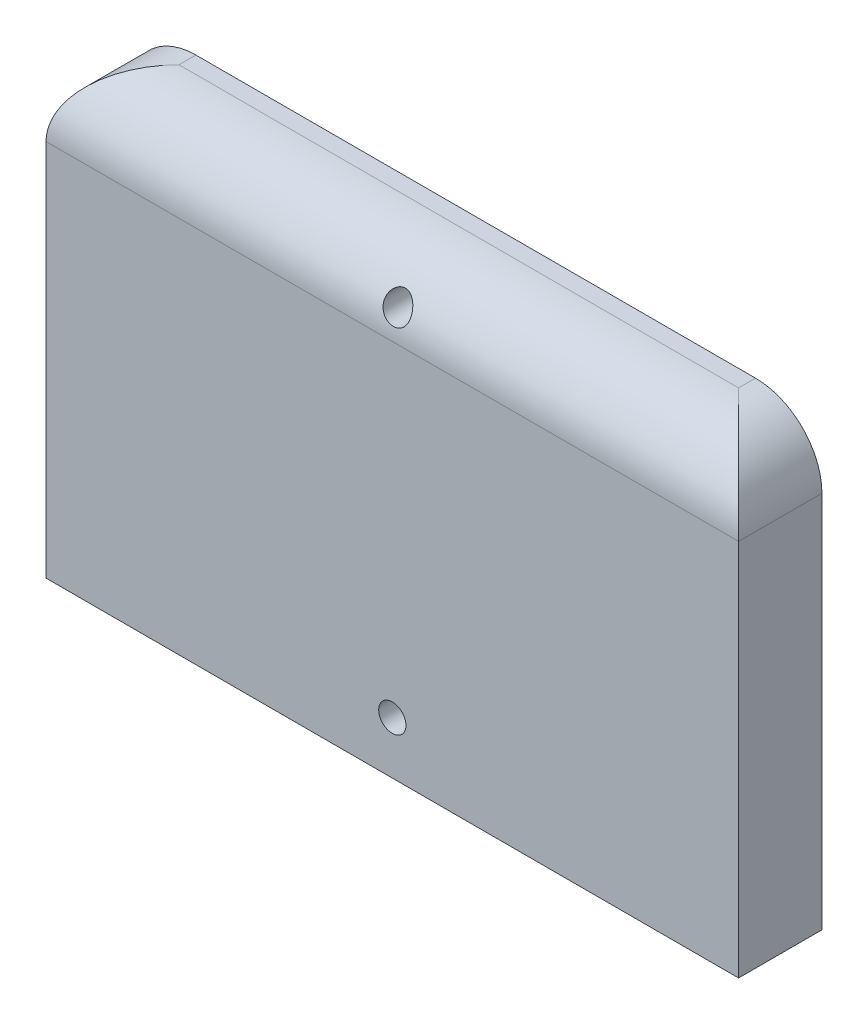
ISO-10303-21;
HEADER;
FILE_DESCRIPTION(('STEP AP214'),'2;1');
FILE_NAME('part.step','',(''),(''),'','','');
FILE_SCHEMA(('AUTOMOTIVE_DESIGN { 1 0 10303 214 1 1 1 1 }'));
ENDSEC;
DATA;
#1=APPLICATION_CONTEXT('core data for automotive mechanical design processes');
#2=APPLICATION_PROTOCOL_DEFINITION('international standard','automotive_design',2000,#1);
#3=PRODUCT_CONTEXT('',#1,'mechanical');
#4=PRODUCT('Part','Part','',(#3));
#5=PRODUCT_RELATED_PRODUCT_CATEGORY('part','',(#4));
#6=PRODUCT_DEFINITION_FORMATION('','',#4);
#7=PRODUCT_DEFINITION_CONTEXT('part definition',#1,'design');
#8=PRODUCT_DEFINITION('design','',#6,#7);
#9=PRODUCT_DEFINITION_SHAPE('','',#8);
#10=(LENGTH_UNIT() NAMED_UNIT(*) SI_UNIT(.MILLI.,.METRE.));
#11=(NAMED_UNIT(*) PLANE_ANGLE_UNIT() SI_UNIT($,.RADIAN.));
#12=(NAMED_UNIT(*) SI_UNIT($,.STERADIAN.) SOLID_ANGLE_UNIT());
#13=UNCERTAINTY_MEASURE_WITH_UNIT(LENGTH_MEASURE(1.E-05),#10,'distance_accuracy_value','');
#14=(GEOMETRIC_REPRESENTATION_CONTEXT(3) GLOBAL_UNCERTAINTY_ASSIGNED_CONTEXT((#13)) GLOBAL_UNIT_ASSIGNED_CONTEXT((#10,
#11,#12)) REPRESENTATION_CONTEXT('',''));
#15=CARTESIAN_POINT('',(0.,0.,0.));
#16=DIRECTION('',(0.,0.,1.));
#17=DIRECTION('',(1.,0.,0.));
#18=AXIS2_PLACEMENT_3D('',#15,#16,#17);
#19=CARTESIAN_POINT('',(-31.75,-20.3835,-5.10424930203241));
#20=DIRECTION('',(-1.,0.,0.));
#21=DIRECTION('',(0.,0.,1.));
#22=AXIS2_PLACEMENT_3D('',#19,#20,#21);
#23=PLANE('',#22);
#24=DIRECTION('',(0.,-1.,0.));
#25=VECTOR('',#24,1.);
#26=CARTESIAN_POINT('',(-31.75,-20.3835,2.54));
#27=LINE('',#26,#25);
#28=CARTESIAN_POINT('',(-31.75,14.2875,2.54));
#29=VERTEX_POINT('',#28);
#30=CARTESIAN_POINT('',(-31.75,-20.3835,2.54));
#31=VERTEX_POINT('',#30);
#32=EDGE_CURVE('E87',#29,#31,#27,.T.);
#33=ORIENTED_EDGE('',*,*,#32,.F.);
#34=DIRECTION('',(0.,0.,1.));
#35=VECTOR('',#34,1.);
#36=CARTESIAN_POINT('',(-31.75,14.2875,-5.10424930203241));
#37=LINE('',#36,#35);
#38=CARTESIAN_POINT('',(-31.75,14.2875,-5.10424930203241));
#39=VERTEX_POINT('',#38);
#40=EDGE_CURVE('E11',#29,#39,#37,.F.);
#41=ORIENTED_EDGE('',*,*,#40,.T.);
#42=DIRECTION('',(0.,-1.,0.));
#43=VECTOR('',#42,1.);
#44=CARTESIAN_POINT('',(-31.75,-20.3835,-5.10424930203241));
#45=LINE('',#44,#43);
#46=CARTESIAN_POINT('',(-31.75,-20.3835,-5.10424930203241));
#47=VERTEX_POINT('',#46);
#48=EDGE_CURVE('E97',#39,#47,#45,.T.);
#49=ORIENTED_EDGE('',*,*,#48,.T.);
#50=DIRECTION('',(0.,0.,1.));
#51=VECTOR('',#50,1.);
#52=CARTESIAN_POINT('',(-31.75,-20.3835,-5.10424930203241));
#53=LINE('',#52,#51);
#54=EDGE_CURVE('E96',#47,#31,#53,.T.);
#55=ORIENTED_EDGE('',*,*,#54,.T.);
#56=EDGE_LOOP('',(#33,#41,#49,#55));
#57=FACE_BOUND('',#56,.T.);
#58=ADVANCED_FACE('F33',(#57),#23,.T.);
#59=CARTESIAN_POINT('',(31.75,20.3835,-5.10424930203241));
#60=DIRECTION('',(0.,1.,0.));
#61=DIRECTION('',(-1.,0.,0.));
#62=AXIS2_PLACEMENT_3D('',#59,#60,#61);
#63=PLANE('',#62);
#64=DIRECTION('',(-1.,0.,0.));
#65=VECTOR('',#64,1.);
#66=CARTESIAN_POINT('',(31.75,20.3835,-3.556));
#67=LINE('',#66,#65);
#68=CARTESIAN_POINT('',(-25.654,20.3835,-3.556));
#69=VERTEX_POINT('',#68);
#70=CARTESIAN_POINT('',(25.654,20.3835,-3.556));
#71=VERTEX_POINT('',#70);
#72=EDGE_CURVE('E124',#69,#71,#67,.F.);
#73=ORIENTED_EDGE('',*,*,#72,.T.);
#74=DIRECTION('',(0.,0.,1.));
#75=VECTOR('',#74,1.);
#76=CARTESIAN_POINT('',(25.654,20.3835,-5.10424930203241));
#77=LINE('',#76,#75);
#78=CARTESIAN_POINT('',(25.654,20.3835,-5.10424930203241));
#79=VERTEX_POINT('',#78);
#80=EDGE_CURVE('E126',#71,#79,#77,.F.);
#81=ORIENTED_EDGE('',*,*,#80,.T.);
#82=DIRECTION('',(-1.,0.,0.));
#83=VECTOR('',#82,1.);
#84=CARTESIAN_POINT('',(31.75,20.3835,-5.10424930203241));
#85=LINE('',#84,#83);
#86=CARTESIAN_POINT('',(-25.654,20.3835,-5.10424930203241));
#87=VERTEX_POINT('',#86);
#88=EDGE_CURVE('E102',#79,#87,#85,.T.);
#89=ORIENTED_EDGE('',*,*,#88,.T.);
#90=DIRECTION('',(0.,0.,1.));
#91=VECTOR('',#90,1.);
#92=CARTESIAN_POINT('',(-25.654,20.3835,-5.10424930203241));
#93=LINE('',#92,#91);
#94=EDGE_CURVE('E122',#87,#69,#93,.T.);
#95=ORIENTED_EDGE('',*,*,#94,.T.);
#96=EDGE_LOOP('',(#73,#81,#89,#95));
#97=FACE_BOUND('',#96,.T.);
#98=ADVANCED_FACE('F148',(#97),#63,.T.);
#99=CARTESIAN_POINT('',(31.75,-20.3835,-5.10424930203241));
#100=DIRECTION('',(1.,0.,0.));
#101=DIRECTION('',(0.,0.,-1.));
#102=AXIS2_PLACEMENT_3D('',#99,#100,#101);
#103=PLANE('',#102);
#104=DIRECTION('',(0.,1.,0.));
#105=VECTOR('',#104,1.);
#106=CARTESIAN_POINT('',(31.75,-20.3835,-5.10424930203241));
#107=LINE('',#106,#105);
#108=CARTESIAN_POINT('',(31.75,-20.3835,-5.10424930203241));
#109=VERTEX_POINT('',#108);
#110=CARTESIAN_POINT('',(31.75,14.2875,-5.10424930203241));
#111=VERTEX_POINT('',#110);
#112=EDGE_CURVE('E113',#109,#111,#107,.T.);
#113=ORIENTED_EDGE('',*,*,#112,.T.);
#114=DIRECTION('',(0.,0.,1.));
#115=VECTOR('',#114,1.);
#116=CARTESIAN_POINT('',(31.75,14.2875,-5.10424930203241));
#117=LINE('',#116,#115);
#118=CARTESIAN_POINT('',(31.75,14.2875,2.54));
#119=VERTEX_POINT('',#118);
#120=EDGE_CURVE('E118',#111,#119,#117,.T.);
#121=ORIENTED_EDGE('',*,*,#120,.T.);
#122=DIRECTION('',(0.,1.,0.));
#123=VECTOR('',#122,1.);
#124=CARTESIAN_POINT('',(31.75,-20.3835,2.54));
#125=LINE('',#124,#123);
#126=CARTESIAN_POINT('',(31.75,-20.3835,2.54));
#127=VERTEX_POINT('',#126);
#128=EDGE_CURVE('E105',#127,#119,#125,.T.);
#129=ORIENTED_EDGE('',*,*,#128,.F.);
#130=DIRECTION('',(0.,0.,1.));
#131=VECTOR('',#130,1.);
#132=CARTESIAN_POINT('',(31.75,-20.3835,-5.10424930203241));
#133=LINE('',#132,#131);
#134=EDGE_CURVE('E101',#109,#127,#133,.T.);
#135=ORIENTED_EDGE('',*,*,#134,.F.);
#136=EDGE_LOOP('',(#113,#121,#129,#135));
#137=FACE_BOUND('',#136,.T.);
#138=ADVANCED_FACE('F155',(#137),#103,.T.);
#139=CARTESIAN_POINT('',(31.75,-20.3835,-5.10424930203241));
#140=DIRECTION('',(0.,-1.,0.));
#141=DIRECTION('',(1.,0.,0.));
#142=AXIS2_PLACEMENT_3D('',#139,#140,#141);
#143=PLANE('',#142);
#144=ORIENTED_EDGE('',*,*,#134,.T.);
#145=DIRECTION('',(1.,0.,0.));
#146=VECTOR('',#145,1.);
#147=CARTESIAN_POINT('',(31.75,-20.3835,2.54));
#148=LINE('',#147,#146);
#149=EDGE_CURVE('E91',#31,#127,#148,.T.);
#150=ORIENTED_EDGE('',*,*,#149,.F.);
#151=ORIENTED_EDGE('',*,*,#54,.F.);
#152=DIRECTION('',(1.,0.,0.));
#153=VECTOR('',#152,1.);
#154=CARTESIAN_POINT('',(31.75,-20.3835,-5.10424930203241));
#155=LINE('',#154,#153);
#156=EDGE_CURVE('E111',#47,#109,#155,.T.);
#157=ORIENTED_EDGE('',*,*,#156,.T.);
#158=EDGE_LOOP('',(#144,#150,#151,#157));
#159=FACE_BOUND('',#158,.T.);
#160=ADVANCED_FACE('F104',(#159),#143,.T.);
#161=CARTESIAN_POINT('',(0.,0.,-5.10424930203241));
#162=DIRECTION('',(0.,0.,1.));
#163=DIRECTION('',(1.,0.,0.));
#164=AXIS2_PLACEMENT_3D('',#161,#162,#163);
#165=PLANE('',#164);
#166=CARTESIAN_POINT('',(0.,-15.5836319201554,-5.1042493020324));
#167=DIRECTION('',(0.,0.,1.));
#168=DIRECTION('',(1.,0.,0.));
#169=AXIS2_PLACEMENT_3D('',#166,#167,#168);
#170=CIRCLE('',#169,1.25000000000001);
#171=CARTESIAN_POINT('',(1.25000000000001,-15.5836319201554,-5.1042493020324));
#172=VERTEX_POINT('',#171);
#173=EDGE_CURVE('E182',#172,#172,#170,.T.);
#174=ORIENTED_EDGE('',*,*,#173,.T.);
#175=EDGE_LOOP('',(#174));
#176=FACE_BOUND('',#175,.T.);
#177=CARTESIAN_POINT('',(0.,16.6743680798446,-5.1042493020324));
#178=DIRECTION('',(0.,0.,1.));
#179=DIRECTION('',(1.,0.,0.));
#180=AXIS2_PLACEMENT_3D('',#177,#178,#179);
#181=CIRCLE('',#180,1.25000000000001);
#182=CARTESIAN_POINT('',(1.25000000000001,16.6743680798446,-5.1042493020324));
#183=VERTEX_POINT('',#182);
#184=EDGE_CURVE('E180',#183,#183,#181,.T.);
#185=ORIENTED_EDGE('',*,*,#184,.T.);
#186=EDGE_LOOP('',(#185));
#187=FACE_BOUND('',#186,.T.);
#188=ORIENTED_EDGE('',*,*,#88,.F.);
#189=CARTESIAN_POINT('',(25.654,14.2875,-5.10424930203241));
#190=DIRECTION('',(0.,0.,1.));
#191=DIRECTION('',(1.,0.,0.));
#192=AXIS2_PLACEMENT_3D('',#189,#190,#191);
#193=CIRCLE('',#192,6.096);
#194=EDGE_CURVE('E130',#79,#111,#193,.F.);
#195=ORIENTED_EDGE('',*,*,#194,.T.);
#196=ORIENTED_EDGE('',*,*,#112,.F.);
#197=ORIENTED_EDGE('',*,*,#156,.F.);
#198=ORIENTED_EDGE('',*,*,#48,.F.);
#199=CARTESIAN_POINT('',(-25.654,14.2875,-5.10424930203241));
#200=DIRECTION('',(0.,0.,1.));
#201=DIRECTION('',(1.,0.,0.));
#202=AXIS2_PLACEMENT_3D('',#199,#200,#201);
#203=CIRCLE('',#202,6.096);
#204=EDGE_CURVE('E128',#39,#87,#203,.F.);
#205=ORIENTED_EDGE('',*,*,#204,.T.);
#206=EDGE_LOOP('',(#188,#195,#196,#197,#198,#205));
#207=FACE_BOUND('',#206,.T.);
#208=ADVANCED_FACE('F145',(#176,#187,#207),#165,.F.);
#209=CARTESIAN_POINT('',(0.,0.,2.54));
#210=DIRECTION('',(0.,0.,1.));
#211=DIRECTION('',(1.,0.,0.));
#212=AXIS2_PLACEMENT_3D('',#209,#210,#211);
#213=PLANE('',#212);
#214=CARTESIAN_POINT('',(0.,-15.5836319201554,2.54));
#215=DIRECTION('',(0.,0.,1.));
#216=DIRECTION('',(1.,0.,0.));
#217=AXIS2_PLACEMENT_3D('',#214,#215,#216);
#218=CIRCLE('',#217,1.25000000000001);
#219=CARTESIAN_POINT('',(1.25000000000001,-15.5836319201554,2.54));
#220=VERTEX_POINT('',#219);
#221=EDGE_CURVE('E186',#220,#220,#218,.T.);
#222=ORIENTED_EDGE('',*,*,#221,.F.);
#223=EDGE_LOOP('',(#222));
#224=FACE_BOUND('',#223,.T.);
#225=ORIENTED_EDGE('',*,*,#128,.T.);
#226=DIRECTION('',(-1.,0.,0.));
#227=VECTOR('',#226,1.);
#228=CARTESIAN_POINT('',(0.,14.2875,2.54));
#229=LINE('',#228,#227);
#230=EDGE_CURVE('E45',#119,#29,#229,.T.);
#231=ORIENTED_EDGE('',*,*,#230,.T.);
#232=ORIENTED_EDGE('',*,*,#32,.T.);
#233=ORIENTED_EDGE('',*,*,#149,.T.);
#234=EDGE_LOOP('',(#225,#231,#232,#233));
#235=FACE_BOUND('',#234,.T.);
#236=ADVANCED_FACE('F89',(#224,#235),#213,.T.);
#237=CARTESIAN_POINT('',(-25.654,14.2875,-5.10424930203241));
#238=DIRECTION('',(0.,0.,1.));
#239=DIRECTION('',(1.,0.,0.));
#240=AXIS2_PLACEMENT_3D('',#237,#238,#239);
#241=CYLINDRICAL_SURFACE('',#240,6.096);
#242=ORIENTED_EDGE('',*,*,#204,.F.);
#243=ORIENTED_EDGE('',*,*,#40,.F.);
#244=CARTESIAN_POINT('',(-25.654,14.2875,-3.556));
#245=DIRECTION('',(0.707106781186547,0.,0.707106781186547));
#246=DIRECTION('',(-0.707106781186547,0.,0.707106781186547));
#247=AXIS2_PLACEMENT_3D('',#244,#245,#246);
#248=ELLIPSE('',#247,8.62104587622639,6.096);
#249=EDGE_CURVE('E93',#69,#29,#248,.T.);
#250=ORIENTED_EDGE('',*,*,#249,.F.);
#251=ORIENTED_EDGE('',*,*,#94,.F.);
#252=EDGE_LOOP('',(#242,#243,#250,#251));
#253=FACE_BOUND('',#252,.T.);
#254=ADVANCED_FACE('F35',(#253),#241,.T.);
#255=CARTESIAN_POINT('',(0.,14.2875,-3.556));
#256=DIRECTION('',(-1.,0.,0.));
#257=DIRECTION('',(0.,-1.,0.));
#258=AXIS2_PLACEMENT_3D('',#255,#256,#257);
#259=CYLINDRICAL_SURFACE('',#258,6.096);
#260=CARTESIAN_POINT('',(1.25000000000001,16.6743680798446,2.05328487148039));
#261=CARTESIAN_POINT('',(1.2499981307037,16.7524157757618,2.02007180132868));
#262=CARTESIAN_POINT('',(1.24267611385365,16.8297891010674,1.98520579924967));
#263=CARTESIAN_POINT('',(1.21426286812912,16.9809544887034,1.91332793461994));
#264=CARTESIAN_POINT('',(1.19315814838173,17.0547429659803,1.87631400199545));
#265=CARTESIAN_POINT('',(1.13815354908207,17.1967588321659,1.80159755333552));
#266=CARTESIAN_POINT('',(1.10428325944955,17.2649986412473,1.76389682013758));
#267=CARTESIAN_POINT('',(1.02449227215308,17.3945825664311,1.68926931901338));
#268=CARTESIAN_POINT('',(0.97856493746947,17.455922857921,1.652342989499));
#269=CARTESIAN_POINT('',(0.874022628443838,17.5714804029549,1.58028648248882));
#270=CARTESIAN_POINT('',(0.815118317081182,17.6254804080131,1.54522458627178));
#271=CARTESIAN_POINT('',(0.68618174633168,17.7222800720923,1.48055522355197));
#272=CARTESIAN_POINT('',(0.616173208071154,17.7651031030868,1.45093641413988));
#273=CARTESIAN_POINT('',(0.488698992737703,17.8263660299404,1.40772981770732));
#274=CARTESIAN_POINT('',(0.43361847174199,17.8482724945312,1.39199009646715));
#275=CARTESIAN_POINT('',(0.319747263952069,17.8842505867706,1.36589983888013));
#276=CARTESIAN_POINT('',(0.260960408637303,17.8983301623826,1.35554383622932));
#277=CARTESIAN_POINT('',(0.14090241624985,17.9178958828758,1.3411007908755));
#278=CARTESIAN_POINT('',(0.0796207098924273,17.9233404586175,1.33704407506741));
#279=CARTESIAN_POINT('',(-0.0431528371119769,17.9251297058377,1.33571426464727));
#280=CARTESIAN_POINT('',(-0.104644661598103,17.9214750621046,1.33844065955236));
#281=CARTESIAN_POINT('',(-0.221201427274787,17.9059390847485,1.34993457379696));
#282=CARTESIAN_POINT('',(-0.276401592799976,17.8946981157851,1.35823161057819));
#283=CARTESIAN_POINT('',(-0.38390477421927,17.8652608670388,1.37970384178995));
#284=CARTESIAN_POINT('',(-0.436207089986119,17.8470629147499,1.39288020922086));
#285=CARTESIAN_POINT('',(-0.540350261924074,17.8030531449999,1.42424861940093));
#286=CARTESIAN_POINT('',(-0.59192426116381,17.7768120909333,1.44271806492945));
#287=CARTESIAN_POINT('',(-0.689998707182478,17.7182403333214,1.48309735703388));
#288=CARTESIAN_POINT('',(-0.736496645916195,17.6859066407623,1.50500889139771));
#289=CARTESIAN_POINT('',(-0.831574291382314,17.6099420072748,1.55526263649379));
#290=CARTESIAN_POINT('',(-0.879123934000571,17.5653243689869,1.5840616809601));
#291=CARTESIAN_POINT('',(-0.966242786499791,17.4700124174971,1.64361493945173));
#292=CARTESIAN_POINT('',(-1.00580641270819,17.4193138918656,1.6743705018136));
#293=CARTESIAN_POINT('',(-1.08229064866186,17.3041792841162,1.74173436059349));
#294=CARTESIAN_POINT('',(-1.1177472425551,17.2388478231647,1.77848430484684));
#295=CARTESIAN_POINT('',(-1.17665265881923,17.1027272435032,1.85155814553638));
#296=CARTESIAN_POINT('',(-1.200096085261,17.0319356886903,1.88788184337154));
#297=CARTESIAN_POINT('',(-1.2350334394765,16.8826265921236,1.96068180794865));
#298=CARTESIAN_POINT('',(-1.24583304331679,16.8038985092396,1.99706536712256));
#299=CARTESIAN_POINT('',(-1.25218322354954,16.6444104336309,2.06661018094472));
#300=CARTESIAN_POINT('',(-1.24773971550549,16.5636512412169,2.09977268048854));
#301=CARTESIAN_POINT('',(-1.22363011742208,16.4077848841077,2.15995715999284));
#302=CARTESIAN_POINT('',(-1.20489963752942,16.3326309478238,2.18722903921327));
#303=CARTESIAN_POINT('',(-1.15320504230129,16.1858387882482,2.23740437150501));
#304=CARTESIAN_POINT('',(-1.12024985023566,16.1141983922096,2.26031055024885));
#305=CARTESIAN_POINT('',(-1.04428890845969,15.9836095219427,2.29965270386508));
#306=CARTESIAN_POINT('',(-1.00245190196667,15.9240990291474,2.31648505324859));
#307=CARTESIAN_POINT('',(-0.908506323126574,15.8127318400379,2.34639029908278));
#308=CARTESIAN_POINT('',(-0.856401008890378,15.7608727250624,2.35946438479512));
#309=CARTESIAN_POINT('',(-0.746503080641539,15.6693448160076,2.38149315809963));
#310=CARTESIAN_POINT('',(-0.689167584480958,15.6291700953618,2.39063170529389));
#311=CARTESIAN_POINT('',(-0.568306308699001,15.5588348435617,2.40606550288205));
#312=CARTESIAN_POINT('',(-0.504781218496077,15.5286731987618,2.41236106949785));
#313=CARTESIAN_POINT('',(-0.374489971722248,15.4797887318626,2.42231742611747));
#314=CARTESIAN_POINT('',(-0.307794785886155,15.4608849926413,2.42602006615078));
#315=CARTESIAN_POINT('',(-0.172114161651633,15.4343460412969,2.43116503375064));
#316=CARTESIAN_POINT('',(-0.103128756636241,15.426710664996,2.43260739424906));
#317=CARTESIAN_POINT('',(0.0350369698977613,15.4229529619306,2.43332103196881));
#318=CARTESIAN_POINT('',(0.104216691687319,15.4268092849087,2.43259633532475));
#319=CARTESIAN_POINT('',(0.240935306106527,15.4458674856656,2.42893887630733));
#320=CARTESIAN_POINT('',(0.308474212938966,15.4610692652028,2.42600613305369));
#321=CARTESIAN_POINT('',(0.439995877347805,15.502338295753,2.41776123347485));
#322=CARTESIAN_POINT('',(0.503978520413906,15.5284058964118,2.41244900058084));
#323=CARTESIAN_POINT('',(0.626571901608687,15.5905644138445,2.39918631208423));
#324=CARTESIAN_POINT('',(0.68518287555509,15.6266548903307,2.39123597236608));
#325=CARTESIAN_POINT('',(0.795444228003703,15.7076971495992,2.37240465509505));
#326=CARTESIAN_POINT('',(0.847090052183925,15.7526546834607,2.36152177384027));
#327=CARTESIAN_POINT('',(0.94201695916,15.849915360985,2.33658760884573));
#328=CARTESIAN_POINT('',(0.985297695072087,15.9022188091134,2.32253619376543));
#329=CARTESIAN_POINT('',(1.06288413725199,16.0130070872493,2.29098107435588));
#330=CARTESIAN_POINT('',(1.09709283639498,16.0715500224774,2.27344331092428));
#331=CARTESIAN_POINT('',(1.15532229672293,16.1924621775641,2.23505809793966));
#332=CARTESIAN_POINT('',(1.179344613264,16.254830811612,2.21421115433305));
#333=CARTESIAN_POINT('',(1.21558461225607,16.3767312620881,2.17114478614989));
#334=CARTESIAN_POINT('',(1.22855876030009,16.436120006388,2.14914900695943));
#335=CARTESIAN_POINT('',(1.24576852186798,16.5552584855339,2.10284962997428));
#336=CARTESIAN_POINT('',(1.25000142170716,16.6150083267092,2.07854531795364));
#337=CARTESIAN_POINT('',(1.25000000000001,16.6743680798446,2.05328487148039));
#338=B_SPLINE_CURVE_WITH_KNOTS('',3,(#260,#261,#262,#263,#264,#265,#266,#267,#268,#269,#270,
#271,#272,#273,#274,#275,#276,#277,#278,#279,#280,#281,#282,#283,#284,#285,#286,#287,#288,#289,
#290,#291,#292,#293,#294,#295,#296,#297,#298,#299,#300,#301,#302,#303,#304,#305,#306,#307,#308,
#309,#310,#311,#312,#313,#314,#315,#316,#317,#318,#319,#320,#321,#322,#323,#324,#325,#326,#327,
#328,#329,#330,#331,#332,#333,#334,#335,#336,#337),.UNSPECIFIED.,.T.,.F.,(4,2,2,2,2,2,2,2,2,2,2,
2,2,2,2,2,2,2,2,2,2,2,2,2,2,2,2,2,2,2,2,2,2,2,2,2,2,2,4),(0.,0.25421439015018,0.508677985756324,
0.762555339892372,1.01657273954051,1.27696137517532,1.53680107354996,1.7200530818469,
1.9031186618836,2.08706287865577,2.2709932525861,2.44107004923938,2.61118775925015,
2.79272960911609,2.97436075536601,3.1873955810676,3.40057884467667,3.64826385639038,
3.89606002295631,4.15690604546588,4.41765085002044,4.66264740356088,4.90749049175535,
5.13033975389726,5.35311841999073,5.56390517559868,5.77466847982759,5.98194635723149,
6.18922121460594,6.39611121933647,6.60299943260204,6.80989430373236,7.01678008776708,
7.22380049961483,7.43082949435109,7.63999031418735,7.84911918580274,8.04240382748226,
8.23574846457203),.UNSPECIFIED.);
#339=CARTESIAN_POINT('',(1.25000000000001,16.6743680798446,2.05328487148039));
#340=VERTEX_POINT('',#339);
#341=EDGE_CURVE('E37',#340,#340,#338,.T.);
#342=ORIENTED_EDGE('',*,*,#341,.F.);
#343=EDGE_LOOP('',(#342));
#344=FACE_BOUND('',#343,.T.);
#345=ORIENTED_EDGE('',*,*,#249,.T.);
#346=ORIENTED_EDGE('',*,*,#230,.F.);
#347=CARTESIAN_POINT('',(25.654,14.2875,-3.556));
#348=DIRECTION('',(-0.707106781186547,0.,0.707106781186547));
#349=DIRECTION('',(-0.707106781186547,0.,-0.707106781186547));
#350=AXIS2_PLACEMENT_3D('',#347,#348,#349);
#351=ELLIPSE('',#350,8.62104587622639,6.096);
#352=EDGE_CURVE('E133',#71,#119,#351,.F.);
#353=ORIENTED_EDGE('',*,*,#352,.F.);
#354=ORIENTED_EDGE('',*,*,#72,.F.);
#355=EDGE_LOOP('',(#345,#346,#353,#354));
#356=FACE_BOUND('',#355,.T.);
#357=ADVANCED_FACE('F138',(#344,#356),#259,.T.);
#358=CARTESIAN_POINT('',(25.654,14.2875,-5.10424930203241));
#359=DIRECTION('',(0.,0.,1.));
#360=DIRECTION('',(1.,0.,0.));
#361=AXIS2_PLACEMENT_3D('',#358,#359,#360);
#362=CYLINDRICAL_SURFACE('',#361,6.096);
#363=ORIENTED_EDGE('',*,*,#194,.F.);
#364=ORIENTED_EDGE('',*,*,#80,.F.);
#365=ORIENTED_EDGE('',*,*,#352,.T.);
#366=ORIENTED_EDGE('',*,*,#120,.F.);
#367=EDGE_LOOP('',(#363,#364,#365,#366));
#368=FACE_BOUND('',#367,.T.);
#369=ADVANCED_FACE('F151',(#368),#362,.T.);
#370=CARTESIAN_POINT('',(0.,16.6743680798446,2.54));
#371=DIRECTION('',(0.,0.,1.));
#372=DIRECTION('',(1.,0.,0.));
#373=AXIS2_PLACEMENT_3D('',#370,#371,#372);
#374=CYLINDRICAL_SURFACE('',#373,1.25000000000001);
#375=ORIENTED_EDGE('',*,*,#341,.T.);
#376=EDGE_LOOP('',(#375));
#377=FACE_BOUND('',#376,.T.);
#378=ORIENTED_EDGE('',*,*,#184,.F.);
#379=EDGE_LOOP('',(#378));
#380=FACE_BOUND('',#379,.T.);
#381=ADVANCED_FACE('F170',(#377,#380),#374,.F.);
#382=CARTESIAN_POINT('',(0.,-15.5836319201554,2.54));
#383=DIRECTION('',(0.,0.,1.));
#384=DIRECTION('',(1.,0.,0.));
#385=AXIS2_PLACEMENT_3D('',#382,#383,#384);
#386=CYLINDRICAL_SURFACE('',#385,1.25000000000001);
#387=ORIENTED_EDGE('',*,*,#173,.F.);
#388=EDGE_LOOP('',(#387));
#389=FACE_BOUND('',#388,.T.);
#390=ORIENTED_EDGE('',*,*,#221,.T.);
#391=EDGE_LOOP('',(#390));
#392=FACE_BOUND('',#391,.T.);
#393=ADVANCED_FACE('F192',(#389,#392),#386,.F.);
#394=CLOSED_SHELL('',(#58,#98,#138,#160,#208,#236,#254,#357,#369,#381,#393));
#395=MANIFOLD_SOLID_BREP('B2',#394);
#396=ADVANCED_BREP_SHAPE_REPRESENTATION('',(#18,#395),#14);
#397=SHAPE_DEFINITION_REPRESENTATION(#9,#396);
ENDSEC;
END-ISO-10303-21;
